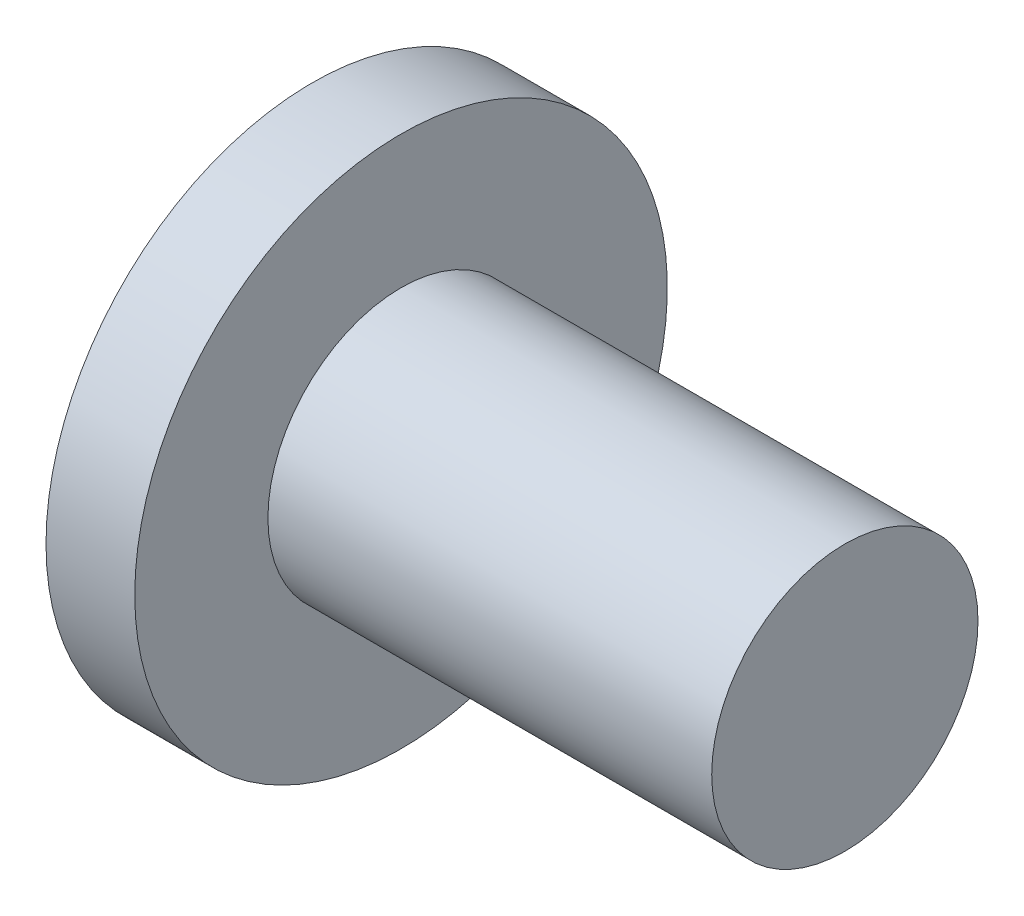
from build123d import *

# Parameters (mm, degrees)
SCALE1_SCALE = 0.75


with BuildPart() as part:
    # Sketch1 → Revolve1 (revolve)
    with BuildSketch(Plane.XY, mode=Mode.PRIVATE) as revolve1_sk:
        Polygon((-2.566371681, 3), (7.433628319, 3), (7.433628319, 0), (-1.890265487, 0), (-4.566371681, 0), (-4.566371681, 6), (-2.566371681, 6), align=None)
    revolve(revolve1_sk.sketch.rotate(Axis((-7.348672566, 0, 0), (1, 0, 0)), 90), axis=Axis((-7.348672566, 0, 0), (1, 0, 0)))


with BuildPart() as part_1:
    # Scale1: scaled about (-0.233038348, 0, 0)
    add(part.part.scale(SCALE1_SCALE).moved(Location((-0.058259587, 0, 0))))


solid = part_1.part
